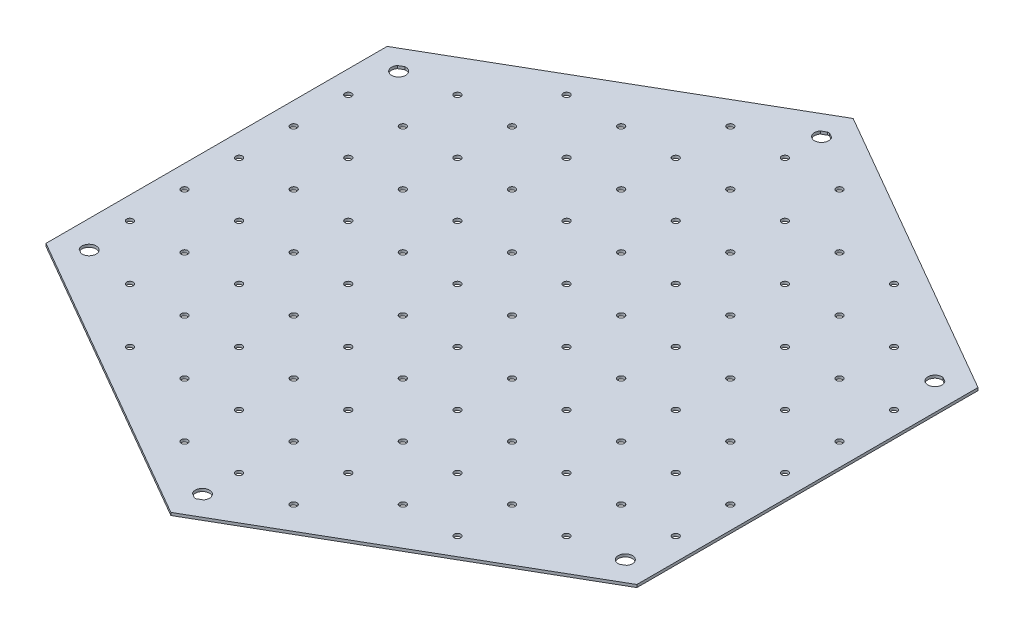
from build123d import *

# Parameters (mm, degrees)
BOSS_EXTRUDE1_DEPTH        = 0.5
SKETCH2_R                  = 0.6
CUT_EXTRUDE1_DEPTH         = 83.681240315
LPATTERN1_COUNT            = 6
LPATTERN1_PITCH            = 10
MIRROR1_COPY_1_SKETCH_R    = 0.6
MIRROR1_COPY_1_DEPTH       = 83.681240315
MIRROR1_COPY_2_SKETCH_R    = 0.6
MIRROR1_COPY_2_DEPTH       = 83.681240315
MIRROR1_COPY_3_SKETCH_R    = 0.6
MIRROR1_COPY_3_DEPTH       = 83.681240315
MIRROR1_COPY_4_SKETCH_R    = 0.6
MIRROR1_COPY_4_DEPTH       = 83.681240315
MIRROR1_COPY_5_SKETCH_R    = 0.6
MIRROR1_COPY_5_DEPTH       = 83.681240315
MIRROR1_COPY_6_SKETCH_R    = 0.6
MIRROR1_COPY_6_DEPTH       = 83.681240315
LPATTERN2_COPY_1_SKETCH_R  = 0.6
LPATTERN2_COPY_1_DEPTH     = 83.681240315
LPATTERN2_COPY_2_SKETCH_R  = 0.6
LPATTERN2_COPY_2_DEPTH     = 83.681240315
LPATTERN2_COPY_3_SKETCH_R  = 0.6
LPATTERN2_COPY_3_DEPTH     = 83.681240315
LPATTERN2_COPY_4_SKETCH_R  = 0.6
LPATTERN2_COPY_4_DEPTH     = 83.681240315
LPATTERN2_COPY_5_SKETCH_R  = 0.6
LPATTERN2_COPY_5_DEPTH     = 83.681240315
LPATTERN2_COPY_6_SKETCH_R  = 0.6
LPATTERN2_COPY_6_DEPTH     = 83.681240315
LPATTERN2_COPY_7_SKETCH_R  = 0.6
LPATTERN2_COPY_7_DEPTH     = 83.681240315
LPATTERN2_COPY_8_SKETCH_R  = 0.6
LPATTERN2_COPY_8_DEPTH     = 83.681240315
LPATTERN2_COPY_9_SKETCH_R  = 0.6
LPATTERN2_COPY_9_DEPTH     = 83.681240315
LPATTERN2_COPY_10_SKETCH_R = 0.6
LPATTERN2_COPY_10_DEPTH    = 83.681240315
LPATTERN2_COPY_11_SKETCH_R = 0.6
LPATTERN2_COPY_11_DEPTH    = 83.681240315
LPATTERN2_COPY_12_SKETCH_R = 0.6
LPATTERN2_COPY_12_DEPTH    = 83.681240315
LPATTERN2_COPY_13_SKETCH_R = 0.6
LPATTERN2_COPY_13_DEPTH    = 83.681240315
LPATTERN2_COPY_14_SKETCH_R = 0.6
LPATTERN2_COPY_14_DEPTH    = 83.681240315
LPATTERN2_COPY_15_SKETCH_R = 0.6
LPATTERN2_COPY_15_DEPTH    = 83.681240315
LPATTERN2_COPY_16_SKETCH_R = 0.6
LPATTERN2_COPY_16_DEPTH    = 83.681240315
LPATTERN2_COPY_17_SKETCH_R = 0.6
LPATTERN2_COPY_17_DEPTH    = 83.681240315
LPATTERN2_COPY_18_SKETCH_R = 0.6
LPATTERN2_COPY_18_DEPTH    = 83.681240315
LPATTERN2_COPY_19_SKETCH_R = 0.6
LPATTERN2_COPY_19_DEPTH    = 83.681240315
LPATTERN2_COPY_20_SKETCH_R = 0.6
LPATTERN2_COPY_20_DEPTH    = 83.681240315
LPATTERN2_COPY_21_SKETCH_R = 0.6
LPATTERN2_COPY_21_DEPTH    = 83.681240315
LPATTERN2_COPY_22_SKETCH_R = 0.6
LPATTERN2_COPY_22_DEPTH    = 83.681240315
LPATTERN2_COPY_23_SKETCH_R = 0.6
LPATTERN2_COPY_23_DEPTH    = 83.681240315
LPATTERN2_COPY_24_SKETCH_R = 0.6
LPATTERN2_COPY_24_DEPTH    = 83.681240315
LPATTERN2_COPY_25_SKETCH_R = 0.6
LPATTERN2_COPY_25_DEPTH    = 83.681240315
LPATTERN2_COPY_26_SKETCH_R = 0.6
LPATTERN2_COPY_26_DEPTH    = 83.681240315
LPATTERN2_COPY_27_SKETCH_R = 0.6
LPATTERN2_COPY_27_DEPTH    = 83.681240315
LPATTERN2_COPY_28_SKETCH_R = 0.6
LPATTERN2_COPY_28_DEPTH    = 83.681240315
LPATTERN2_COPY_29_SKETCH_R = 0.6
LPATTERN2_COPY_29_DEPTH    = 83.681240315
LPATTERN2_COPY_30_SKETCH_R = 0.6
LPATTERN2_COPY_30_DEPTH    = 83.681240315
LPATTERN2_COPY_31_SKETCH_R = 0.6
LPATTERN2_COPY_31_DEPTH    = 83.681240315
LPATTERN2_COPY_32_SKETCH_R = 0.6
LPATTERN2_COPY_32_DEPTH    = 83.681240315
LPATTERN2_COPY_33_SKETCH_R = 0.6
LPATTERN2_COPY_33_DEPTH    = 83.681240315
LPATTERN2_COPY_34_SKETCH_R = 0.6
LPATTERN2_COPY_34_DEPTH    = 83.681240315
LPATTERN2_COPY_35_SKETCH_R = 0.6
LPATTERN2_COPY_35_DEPTH    = 83.681240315
LPATTERN2_COPY_36_SKETCH_R = 0.6
LPATTERN2_COPY_36_DEPTH    = 83.681240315
LPATTERN2_COPY_37_SKETCH_R = 0.6
LPATTERN2_COPY_37_DEPTH    = 83.681240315
LPATTERN2_COPY_38_SKETCH_R = 0.6
LPATTERN2_COPY_38_DEPTH    = 83.681240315
LPATTERN2_COPY_39_SKETCH_R = 0.6
LPATTERN2_COPY_39_DEPTH    = 83.681240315
LPATTERN2_COPY_40_SKETCH_R = 0.6
LPATTERN2_COPY_40_DEPTH    = 83.681240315
LPATTERN2_COPY_41_SKETCH_R = 0.6
LPATTERN2_COPY_41_DEPTH    = 83.681240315
LPATTERN2_COPY_42_SKETCH_R = 0.6
LPATTERN2_COPY_42_DEPTH    = 83.681240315
LPATTERN2_COPY_43_SKETCH_R = 0.6
LPATTERN2_COPY_43_DEPTH    = 83.681240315
LPATTERN2_COPY_44_SKETCH_R = 0.6
LPATTERN2_COPY_44_DEPTH    = 83.681240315
LPATTERN2_COPY_45_SKETCH_R = 0.6
LPATTERN2_COPY_45_DEPTH    = 83.681240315
LPATTERN2_COPY_46_SKETCH_R = 0.6
LPATTERN2_COPY_46_DEPTH    = 83.681240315
LPATTERN2_COPY_47_SKETCH_R = 0.6
LPATTERN2_COPY_47_DEPTH    = 83.681240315
LPATTERN2_COPY_48_SKETCH_R = 0.6
LPATTERN2_COPY_48_DEPTH    = 83.681240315
LPATTERN2_COPY_49_SKETCH_R = 0.6
LPATTERN2_COPY_49_DEPTH    = 83.681240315
LPATTERN2_COPY_50_SKETCH_R = 0.6
LPATTERN2_COPY_50_DEPTH    = 83.681240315
LPATTERN2_COPY_51_SKETCH_R = 0.6
LPATTERN2_COPY_51_DEPTH    = 83.681240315
LPATTERN2_COPY_52_SKETCH_R = 0.6
LPATTERN2_COPY_52_DEPTH    = 83.681240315
LPATTERN2_COPY_53_SKETCH_R = 0.6
LPATTERN2_COPY_53_DEPTH    = 83.681240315
LPATTERN2_COPY_54_SKETCH_R = 0.6
LPATTERN2_COPY_54_DEPTH    = 83.681240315
LPATTERN2_COPY_55_SKETCH_R = 0.6
LPATTERN2_COPY_55_DEPTH    = 83.681240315
LPATTERN2_COPY_56_SKETCH_R = 0.6
LPATTERN2_COPY_56_DEPTH    = 83.681240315
LPATTERN2_COPY_57_SKETCH_R = 0.6
LPATTERN2_COPY_57_DEPTH    = 83.681240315
LPATTERN2_COPY_58_SKETCH_R = 0.6
LPATTERN2_COPY_58_DEPTH    = 83.681240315
LPATTERN2_COPY_59_SKETCH_R = 0.6
LPATTERN2_COPY_59_DEPTH    = 83.681240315
LPATTERN2_COPY_60_SKETCH_R = 0.6
LPATTERN2_COPY_60_DEPTH    = 83.681240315
LPATTERN2_COPY_61_SKETCH_R = 0.6
LPATTERN2_COPY_61_DEPTH    = 83.681240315
LPATTERN2_COPY_62_SKETCH_R = 0.6
LPATTERN2_COPY_62_DEPTH    = 83.681240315
LPATTERN2_COPY_63_SKETCH_R = 0.6
LPATTERN2_COPY_63_DEPTH    = 83.681240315
LPATTERN2_COPY_64_SKETCH_R = 0.6
LPATTERN2_COPY_64_DEPTH    = 83.681240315
LPATTERN2_COPY_65_SKETCH_R = 0.6
LPATTERN2_COPY_65_DEPTH    = 83.681240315
LPATTERN2_COPY_66_SKETCH_R = 0.6
LPATTERN2_COPY_66_DEPTH    = 83.681240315
LPATTERN2_COPY_67_SKETCH_R = 0.6
LPATTERN2_COPY_67_DEPTH    = 83.681240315
LPATTERN2_COPY_68_SKETCH_R = 0.6
LPATTERN2_COPY_68_DEPTH    = 83.681240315
LPATTERN2_COPY_69_SKETCH_R = 0.6
LPATTERN2_COPY_69_DEPTH    = 83.681240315
LPATTERN2_COPY_70_SKETCH_R = 0.6
LPATTERN2_COPY_70_DEPTH    = 83.681240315
LPATTERN2_COPY_71_SKETCH_R = 0.6
LPATTERN2_COPY_71_DEPTH    = 83.681240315
LPATTERN2_COPY_72_SKETCH_R = 0.6
LPATTERN2_COPY_72_DEPTH    = 83.681240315
LPATTERN2_COPY_73_SKETCH_R = 0.6
LPATTERN2_COPY_73_DEPTH    = 83.681240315
LPATTERN2_COPY_74_SKETCH_R = 0.6
LPATTERN2_COPY_74_DEPTH    = 83.681240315
LPATTERN2_COPY_75_SKETCH_R = 0.6
LPATTERN2_COPY_75_DEPTH    = 83.681240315
LPATTERN2_COPY_76_SKETCH_R = 0.6
LPATTERN2_COPY_76_DEPTH    = 83.681240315
LPATTERN2_COPY_77_SKETCH_R = 0.6
LPATTERN2_COPY_77_DEPTH    = 83.681240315
LPATTERN2_COPY_78_SKETCH_R = 0.6
LPATTERN2_COPY_78_DEPTH    = 83.681240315
MIRROR2_COPY_1_SKETCH_R    = 0.6
MIRROR2_COPY_1_DEPTH       = 83.681240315
MIRROR2_COPY_2_SKETCH_R    = 0.6
MIRROR2_COPY_2_DEPTH       = 83.681240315
MIRROR2_COPY_3_SKETCH_R    = 0.6
MIRROR2_COPY_3_DEPTH       = 83.681240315
MIRROR2_COPY_4_SKETCH_R    = 0.6
MIRROR2_COPY_4_DEPTH       = 83.681240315
MIRROR2_COPY_5_SKETCH_R    = 0.6
MIRROR2_COPY_5_DEPTH       = 83.681240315
MIRROR2_COPY_6_SKETCH_R    = 0.6
MIRROR2_COPY_6_DEPTH       = 83.681240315
MIRROR2_COPY_7_SKETCH_R    = 0.6
MIRROR2_COPY_7_DEPTH       = 83.681240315
MIRROR2_COPY_8_SKETCH_R    = 0.6
MIRROR2_COPY_8_DEPTH       = 83.681240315
MIRROR2_COPY_9_SKETCH_R    = 0.6
MIRROR2_COPY_9_DEPTH       = 83.681240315
MIRROR2_COPY_10_SKETCH_R   = 0.6
MIRROR2_COPY_10_DEPTH      = 83.681240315
MIRROR2_COPY_11_SKETCH_R   = 0.6
MIRROR2_COPY_11_DEPTH      = 83.681240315
MIRROR2_COPY_12_SKETCH_R   = 0.6
MIRROR2_COPY_12_DEPTH      = 83.681240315
MIRROR2_COPY_13_SKETCH_R   = 0.6
MIRROR2_COPY_13_DEPTH      = 83.681240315
MIRROR2_COPY_14_SKETCH_R   = 0.6
MIRROR2_COPY_14_DEPTH      = 83.681240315
MIRROR2_COPY_15_SKETCH_R   = 0.6
MIRROR2_COPY_15_DEPTH      = 83.681240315
MIRROR2_COPY_16_SKETCH_R   = 0.6
MIRROR2_COPY_16_DEPTH      = 83.681240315
MIRROR2_COPY_17_SKETCH_R   = 0.6
MIRROR2_COPY_17_DEPTH      = 83.681240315
MIRROR2_COPY_18_SKETCH_R   = 0.6
MIRROR2_COPY_18_DEPTH      = 83.681240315
MIRROR2_COPY_19_SKETCH_R   = 0.6
MIRROR2_COPY_19_DEPTH      = 83.681240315
MIRROR2_COPY_20_SKETCH_R   = 0.6
MIRROR2_COPY_20_DEPTH      = 83.681240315
MIRROR2_COPY_21_SKETCH_R   = 0.6
MIRROR2_COPY_21_DEPTH      = 83.681240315
MIRROR2_COPY_22_SKETCH_R   = 0.6
MIRROR2_COPY_22_DEPTH      = 83.681240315
MIRROR2_COPY_23_SKETCH_R   = 0.6
MIRROR2_COPY_23_DEPTH      = 83.681240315
MIRROR2_COPY_24_SKETCH_R   = 0.6
MIRROR2_COPY_24_DEPTH      = 83.681240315
MIRROR2_COPY_25_SKETCH_R   = 0.6
MIRROR2_COPY_25_DEPTH      = 83.681240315
MIRROR2_COPY_26_SKETCH_R   = 0.6
MIRROR2_COPY_26_DEPTH      = 83.681240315
MIRROR2_COPY_27_SKETCH_R   = 0.6
MIRROR2_COPY_27_DEPTH      = 83.681240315
MIRROR2_COPY_28_SKETCH_R   = 0.6
MIRROR2_COPY_28_DEPTH      = 83.681240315
MIRROR2_COPY_29_SKETCH_R   = 0.6
MIRROR2_COPY_29_DEPTH      = 83.681240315
MIRROR2_COPY_30_SKETCH_R   = 0.6
MIRROR2_COPY_30_DEPTH      = 83.681240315
MIRROR2_COPY_31_SKETCH_R   = 0.6
MIRROR2_COPY_31_DEPTH      = 83.681240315
MIRROR2_COPY_32_SKETCH_R   = 0.6
MIRROR2_COPY_32_DEPTH      = 83.681240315
MIRROR2_COPY_33_SKETCH_R   = 0.6
MIRROR2_COPY_33_DEPTH      = 83.681240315
MIRROR2_COPY_34_SKETCH_R   = 0.6
MIRROR2_COPY_34_DEPTH      = 83.681240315
MIRROR2_COPY_35_SKETCH_R   = 0.6
MIRROR2_COPY_35_DEPTH      = 83.681240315
MIRROR2_COPY_36_SKETCH_R   = 0.6
MIRROR2_COPY_36_DEPTH      = 83.681240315
MIRROR2_COPY_37_SKETCH_R   = 0.6
MIRROR2_COPY_37_DEPTH      = 83.681240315
MIRROR2_COPY_38_SKETCH_R   = 0.6
MIRROR2_COPY_38_DEPTH      = 83.681240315
MIRROR2_COPY_39_SKETCH_R   = 0.6
MIRROR2_COPY_39_DEPTH      = 83.681240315
MIRROR2_COPY_40_SKETCH_R   = 0.6
MIRROR2_COPY_40_DEPTH      = 83.681240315
MIRROR2_COPY_41_SKETCH_R   = 0.6
MIRROR2_COPY_41_DEPTH      = 83.681240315
MIRROR2_COPY_42_SKETCH_R   = 0.6
MIRROR2_COPY_42_DEPTH      = 83.681240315
MIRROR2_COPY_43_SKETCH_R   = 0.6
MIRROR2_COPY_43_DEPTH      = 83.681240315
MIRROR2_COPY_44_SKETCH_R   = 0.6
MIRROR2_COPY_44_DEPTH      = 83.681240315
MIRROR2_COPY_45_SKETCH_R   = 0.6
MIRROR2_COPY_45_DEPTH      = 83.681240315
MIRROR2_COPY_46_SKETCH_R   = 0.6
MIRROR2_COPY_46_DEPTH      = 83.681240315
MIRROR2_COPY_47_SKETCH_R   = 0.6
MIRROR2_COPY_47_DEPTH      = 83.681240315
MIRROR2_COPY_48_SKETCH_R   = 0.6
MIRROR2_COPY_48_DEPTH      = 83.681240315
MIRROR2_COPY_49_SKETCH_R   = 0.6
MIRROR2_COPY_49_DEPTH      = 83.681240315
MIRROR2_COPY_50_SKETCH_R   = 0.6
MIRROR2_COPY_50_DEPTH      = 83.681240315
MIRROR2_COPY_51_SKETCH_R   = 0.6
MIRROR2_COPY_51_DEPTH      = 83.681240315
MIRROR2_COPY_52_SKETCH_R   = 0.6
MIRROR2_COPY_52_DEPTH      = 83.681240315
MIRROR2_COPY_53_SKETCH_R   = 0.6
MIRROR2_COPY_53_DEPTH      = 83.681240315
MIRROR2_COPY_54_SKETCH_R   = 0.6
MIRROR2_COPY_54_DEPTH      = 83.681240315
MIRROR2_COPY_55_SKETCH_R   = 0.6
MIRROR2_COPY_55_DEPTH      = 83.681240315
MIRROR2_COPY_56_SKETCH_R   = 0.6
MIRROR2_COPY_56_DEPTH      = 83.681240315
MIRROR2_COPY_57_SKETCH_R   = 0.6
MIRROR2_COPY_57_DEPTH      = 83.681240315
MIRROR2_COPY_58_SKETCH_R   = 0.6
MIRROR2_COPY_58_DEPTH      = 83.681240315
MIRROR2_COPY_59_SKETCH_R   = 0.6
MIRROR2_COPY_59_DEPTH      = 83.681240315
MIRROR2_COPY_60_SKETCH_R   = 0.6
MIRROR2_COPY_60_DEPTH      = 83.681240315
MIRROR2_COPY_61_SKETCH_R   = 0.6
MIRROR2_COPY_61_DEPTH      = 83.681240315
MIRROR2_COPY_62_SKETCH_R   = 0.6
MIRROR2_COPY_62_DEPTH      = 83.681240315
MIRROR2_COPY_63_SKETCH_R   = 0.6
MIRROR2_COPY_63_DEPTH      = 83.681240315
MIRROR2_COPY_64_SKETCH_R   = 0.6
MIRROR2_COPY_64_DEPTH      = 83.681240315
MIRROR2_COPY_65_SKETCH_R   = 0.6
MIRROR2_COPY_65_DEPTH      = 83.681240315
MIRROR2_COPY_66_SKETCH_R   = 0.6
MIRROR2_COPY_66_DEPTH      = 83.681240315
MIRROR2_COPY_67_SKETCH_R   = 0.6
MIRROR2_COPY_67_DEPTH      = 83.681240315
MIRROR2_COPY_68_SKETCH_R   = 0.6
MIRROR2_COPY_68_DEPTH      = 83.681240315
MIRROR2_COPY_69_SKETCH_R   = 0.6
MIRROR2_COPY_69_DEPTH      = 83.681240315
MIRROR2_COPY_70_SKETCH_R   = 0.6
MIRROR2_COPY_70_DEPTH      = 83.681240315
MIRROR2_COPY_71_SKETCH_R   = 0.6
MIRROR2_COPY_71_DEPTH      = 83.681240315
MIRROR2_COPY_72_SKETCH_R   = 0.6
MIRROR2_COPY_72_DEPTH      = 83.681240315
MIRROR2_COPY_73_SKETCH_R   = 0.6
MIRROR2_COPY_73_DEPTH      = 83.681240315
MIRROR2_COPY_74_SKETCH_R   = 0.6
MIRROR2_COPY_74_DEPTH      = 83.681240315
MIRROR2_COPY_75_SKETCH_R   = 0.6
MIRROR2_COPY_75_DEPTH      = 83.681240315
MIRROR2_COPY_76_SKETCH_R   = 0.6
MIRROR2_COPY_76_DEPTH      = 83.681240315
MIRROR2_COPY_77_SKETCH_R   = 0.6
MIRROR2_COPY_77_DEPTH      = 83.681240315
MIRROR2_COPY_78_SKETCH_R   = 0.6
MIRROR2_COPY_78_DEPTH      = 83.681240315
MIRROR2_COPY_79_SKETCH_R   = 0.6
MIRROR2_COPY_79_DEPTH      = 83.681240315
SKETCH4_R                  = 1.3
CUT_EXTRUDE3_DEPTH         = 83.681240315
BOSS_EXTRUDE2_DEPTH        = 0.5
BOSS_EXTRUDE3_DEPTH        = 0.5
BOSS_EXTRUDE4_DEPTH        = 0.5


with BuildPart() as part:
    # Sketch1 → Boss-Extrude1 (new body)
    with BuildSketch(Plane(origin=(0, 0, 0), x_dir=(1, 0, 0), z_dir=(0, 1, 0))):
        Polygon((0, 62.5), (-54.126587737, 31.25), (-54.126587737, -31.25), (0, -62.5), (54.126587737, -31.25), (54.126587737, 31.25), align=None)
    extrude(amount=BOSS_EXTRUDE1_DEPTH)

    # Sketch2 → Cut-Extrude1 (cut, through all)
    with BuildSketch(Plane(origin=(0, 0.5, 0), x_dir=(1, 0, 0), z_dir=(0, 1, 0))):
        with Locations(Location((0, 0, 0), (0, 0, 270))):
            Circle(SKETCH2_R)
    cut_extrude1 = extrude(amount=-CUT_EXTRUDE1_DEPTH, mode=Mode.SUBTRACT)

    # LPattern1: Cut-Extrude1 ×6
    with Locations(*[(-i * LPATTERN1_PITCH, 0, 0) for i in range(1, LPATTERN1_COUNT)]):
        add(cut_extrude1, mode=Mode.SUBTRACT)

    # Mirror1 copy 1 sketch → Mirror1 copy 1 (cut, through all)
    with BuildSketch(Plane(origin=(10, 0.5, 0), x_dir=(-1, 0, 0), z_dir=(0, 1, 0))):
        Circle(MIRROR1_COPY_1_SKETCH_R)
    extrude(amount=-MIRROR1_COPY_1_DEPTH, mode=Mode.SUBTRACT)

    # Mirror1 copy 2 sketch → Mirror1 copy 2 (cut, through all)
    with BuildSketch(Plane(origin=(20, 0.5, 0), x_dir=(-1, 0, 0), z_dir=(0, 1, 0))):
        Circle(MIRROR1_COPY_2_SKETCH_R)
    extrude(amount=-MIRROR1_COPY_2_DEPTH, mode=Mode.SUBTRACT)

    # Mirror1 copy 3 sketch → Mirror1 copy 3 (cut, through all)
    with BuildSketch(Plane(origin=(30, 0.5, 0), x_dir=(-1, 0, 0), z_dir=(0, 1, 0))):
        Circle(MIRROR1_COPY_3_SKETCH_R)
    extrude(amount=-MIRROR1_COPY_3_DEPTH, mode=Mode.SUBTRACT)

    # Mirror1 copy 4 sketch → Mirror1 copy 4 (cut, through all)
    with BuildSketch(Plane(origin=(40, 0.5, 0), x_dir=(-1, 0, 0), z_dir=(0, 1, 0))):
        Circle(MIRROR1_COPY_4_SKETCH_R)
    extrude(amount=-MIRROR1_COPY_4_DEPTH, mode=Mode.SUBTRACT)

    # Mirror1 copy 5 sketch → Mirror1 copy 5 (cut, through all)
    with BuildSketch(Plane(origin=(50, 0.5, 0), x_dir=(-1, 0, 0), z_dir=(0, 1, 0))):
        Circle(MIRROR1_COPY_5_SKETCH_R)
    extrude(amount=-MIRROR1_COPY_5_DEPTH, mode=Mode.SUBTRACT)

    # Mirror1 copy 6 sketch → Mirror1 copy 6 (cut, through all)
    with BuildSketch(Plane(origin=(0, 0.5, 0), x_dir=(-1, 0, 0), z_dir=(0, 1, 0))):
        Circle(MIRROR1_COPY_6_SKETCH_R)
    extrude(amount=-MIRROR1_COPY_6_DEPTH, mode=Mode.SUBTRACT)

    # LPattern2 copy 1 sketch → LPattern2 copy 1 (cut, through all)
    with BuildSketch(Plane(origin=(-10, 0.5, 10), x_dir=(1, 0, 0), z_dir=(0, 1, 0))):
        with Locations(Location((0, 0, 0), (0, 0, 270))):
            Circle(LPATTERN2_COPY_1_SKETCH_R)
    extrude(amount=-LPATTERN2_COPY_1_DEPTH, mode=Mode.SUBTRACT)

    # LPattern2 copy 2 sketch → LPattern2 copy 2 (cut, through all)
    with BuildSketch(Plane(origin=(-10, 0.5, 20), x_dir=(1, 0, 0), z_dir=(0, 1, 0))):
        with Locations(Location((0, 0, 0), (0, 0, 270))):
            Circle(LPATTERN2_COPY_2_SKETCH_R)
    extrude(amount=-LPATTERN2_COPY_2_DEPTH, mode=Mode.SUBTRACT)

    # LPattern2 copy 3 sketch → LPattern2 copy 3 (cut, through all)
    with BuildSketch(Plane(origin=(-10, 0.5, 30), x_dir=(1, 0, 0), z_dir=(0, 1, 0))):
        with Locations(Location((0, 0, 0), (0, 0, 270))):
            Circle(LPATTERN2_COPY_3_SKETCH_R)
    extrude(amount=-LPATTERN2_COPY_3_DEPTH, mode=Mode.SUBTRACT)

    # LPattern2 copy 4 sketch → LPattern2 copy 4 (cut, through all)
    with BuildSketch(Plane(origin=(-10, 0.5, 40), x_dir=(1, 0, 0), z_dir=(0, 1, 0))):
        with Locations(Location((0, 0, 0), (0, 0, 270))):
            Circle(LPATTERN2_COPY_4_SKETCH_R)
    extrude(amount=-LPATTERN2_COPY_4_DEPTH, mode=Mode.SUBTRACT)

    # LPattern2 copy 5 sketch → LPattern2 copy 5 (cut, through all)
    with BuildSketch(Plane(origin=(-10, 0.5, 50), x_dir=(1, 0, 0), z_dir=(0, 1, 0))):
        with Locations(Location((0, 0, 0), (0, 0, 270))):
            Circle(LPATTERN2_COPY_5_SKETCH_R)
    extrude(amount=-LPATTERN2_COPY_5_DEPTH, mode=Mode.SUBTRACT)

    # LPattern2 copy 6 sketch → LPattern2 copy 6 (cut, through all)
    with BuildSketch(Plane(origin=(-10, 0.5, 60), x_dir=(1, 0, 0), z_dir=(0, 1, 0))):
        with Locations(Location((0, 0, 0), (0, 0, 270))):
            Circle(LPATTERN2_COPY_6_SKETCH_R)
    extrude(amount=-LPATTERN2_COPY_6_DEPTH, mode=Mode.SUBTRACT)

    # LPattern2 copy 7 sketch → LPattern2 copy 7 (cut, through all)
    with BuildSketch(Plane(origin=(-20, 0.5, 10), x_dir=(1, 0, 0), z_dir=(0, 1, 0))):
        with Locations(Location((0, 0, 0), (0, 0, 270))):
            Circle(LPATTERN2_COPY_7_SKETCH_R)
    extrude(amount=-LPATTERN2_COPY_7_DEPTH, mode=Mode.SUBTRACT)

    # LPattern2 copy 8 sketch → LPattern2 copy 8 (cut, through all)
    with BuildSketch(Plane(origin=(-20, 0.5, 20), x_dir=(1, 0, 0), z_dir=(0, 1, 0))):
        with Locations(Location((0, 0, 0), (0, 0, 270))):
            Circle(LPATTERN2_COPY_8_SKETCH_R)
    extrude(amount=-LPATTERN2_COPY_8_DEPTH, mode=Mode.SUBTRACT)

    # LPattern2 copy 9 sketch → LPattern2 copy 9 (cut, through all)
    with BuildSketch(Plane(origin=(-20, 0.5, 30), x_dir=(1, 0, 0), z_dir=(0, 1, 0))):
        with Locations(Location((0, 0, 0), (0, 0, 270))):
            Circle(LPATTERN2_COPY_9_SKETCH_R)
    extrude(amount=-LPATTERN2_COPY_9_DEPTH, mode=Mode.SUBTRACT)

    # LPattern2 copy 10 sketch → LPattern2 copy 10 (cut, through all)
    with BuildSketch(Plane(origin=(-20, 0.5, 40), x_dir=(1, 0, 0), z_dir=(0, 1, 0))):
        with Locations(Location((0, 0, 0), (0, 0, 270))):
            Circle(LPATTERN2_COPY_10_SKETCH_R)
    extrude(amount=-LPATTERN2_COPY_10_DEPTH, mode=Mode.SUBTRACT)

    # LPattern2 copy 11 sketch → LPattern2 copy 11 (cut, through all)
    with BuildSketch(Plane(origin=(-20, 0.5, 50), x_dir=(1, 0, 0), z_dir=(0, 1, 0))):
        with Locations(Location((0, 0, 0), (0, 0, 270))):
            Circle(LPATTERN2_COPY_11_SKETCH_R)
    extrude(amount=-LPATTERN2_COPY_11_DEPTH, mode=Mode.SUBTRACT)

    # LPattern2 copy 12 sketch → LPattern2 copy 12 (cut, through all)
    with BuildSketch(Plane(origin=(-20, 0.5, 60), x_dir=(1, 0, 0), z_dir=(0, 1, 0))):
        with Locations(Location((0, 0, 0), (0, 0, 270))):
            Circle(LPATTERN2_COPY_12_SKETCH_R)
    extrude(amount=-LPATTERN2_COPY_12_DEPTH, mode=Mode.SUBTRACT)

    # LPattern2 copy 13 sketch → LPattern2 copy 13 (cut, through all)
    with BuildSketch(Plane(origin=(-30, 0.5, 10), x_dir=(1, 0, 0), z_dir=(0, 1, 0))):
        with Locations(Location((0, 0, 0), (0, 0, 270))):
            Circle(LPATTERN2_COPY_13_SKETCH_R)
    extrude(amount=-LPATTERN2_COPY_13_DEPTH, mode=Mode.SUBTRACT)

    # LPattern2 copy 14 sketch → LPattern2 copy 14 (cut, through all)
    with BuildSketch(Plane(origin=(-30, 0.5, 20), x_dir=(1, 0, 0), z_dir=(0, 1, 0))):
        with Locations(Location((0, 0, 0), (0, 0, 270))):
            Circle(LPATTERN2_COPY_14_SKETCH_R)
    extrude(amount=-LPATTERN2_COPY_14_DEPTH, mode=Mode.SUBTRACT)

    # LPattern2 copy 15 sketch → LPattern2 copy 15 (cut, through all)
    with BuildSketch(Plane(origin=(-30, 0.5, 30), x_dir=(1, 0, 0), z_dir=(0, 1, 0))):
        with Locations(Location((0, 0, 0), (0, 0, 270))):
            Circle(LPATTERN2_COPY_15_SKETCH_R)
    extrude(amount=-LPATTERN2_COPY_15_DEPTH, mode=Mode.SUBTRACT)

    # LPattern2 copy 16 sketch → LPattern2 copy 16 (cut, through all)
    with BuildSketch(Plane(origin=(-30, 0.5, 40), x_dir=(1, 0, 0), z_dir=(0, 1, 0))):
        with Locations(Location((0, 0, 0), (0, 0, 270))):
            Circle(LPATTERN2_COPY_16_SKETCH_R)
    extrude(amount=-LPATTERN2_COPY_16_DEPTH, mode=Mode.SUBTRACT)

    # LPattern2 copy 17 sketch → LPattern2 copy 17 (cut, through all)
    with BuildSketch(Plane(origin=(-30, 0.5, 50), x_dir=(1, 0, 0), z_dir=(0, 1, 0))):
        with Locations(Location((0, 0, 0), (0, 0, 270))):
            Circle(LPATTERN2_COPY_17_SKETCH_R)
    extrude(amount=-LPATTERN2_COPY_17_DEPTH, mode=Mode.SUBTRACT)

    # LPattern2 copy 18 sketch → LPattern2 copy 18 (cut, through all)
    with BuildSketch(Plane(origin=(-30, 0.5, 60), x_dir=(1, 0, 0), z_dir=(0, 1, 0))):
        with Locations(Location((0, 0, 0), (0, 0, 270))):
            Circle(LPATTERN2_COPY_18_SKETCH_R)
    extrude(amount=-LPATTERN2_COPY_18_DEPTH, mode=Mode.SUBTRACT)

    # LPattern2 copy 19 sketch → LPattern2 copy 19 (cut, through all)
    with BuildSketch(Plane(origin=(-40, 0.5, 10), x_dir=(1, 0, 0), z_dir=(0, 1, 0))):
        with Locations(Location((0, 0, 0), (0, 0, 270))):
            Circle(LPATTERN2_COPY_19_SKETCH_R)
    extrude(amount=-LPATTERN2_COPY_19_DEPTH, mode=Mode.SUBTRACT)

    # LPattern2 copy 20 sketch → LPattern2 copy 20 (cut, through all)
    with BuildSketch(Plane(origin=(-40, 0.5, 20), x_dir=(1, 0, 0), z_dir=(0, 1, 0))):
        with Locations(Location((0, 0, 0), (0, 0, 270))):
            Circle(LPATTERN2_COPY_20_SKETCH_R)
    extrude(amount=-LPATTERN2_COPY_20_DEPTH, mode=Mode.SUBTRACT)

    # LPattern2 copy 21 sketch → LPattern2 copy 21 (cut, through all)
    with BuildSketch(Plane(origin=(-40, 0.5, 30), x_dir=(1, 0, 0), z_dir=(0, 1, 0))):
        with Locations(Location((0, 0, 0), (0, 0, 270))):
            Circle(LPATTERN2_COPY_21_SKETCH_R)
    extrude(amount=-LPATTERN2_COPY_21_DEPTH, mode=Mode.SUBTRACT)

    # LPattern2 copy 22 sketch → LPattern2 copy 22 (cut, through all)
    with BuildSketch(Plane(origin=(-40, 0.5, 40), x_dir=(1, 0, 0), z_dir=(0, 1, 0))):
        with Locations(Location((0, 0, 0), (0, 0, 270))):
            Circle(LPATTERN2_COPY_22_SKETCH_R)
    extrude(amount=-LPATTERN2_COPY_22_DEPTH, mode=Mode.SUBTRACT)

    # LPattern2 copy 23 sketch → LPattern2 copy 23 (cut, through all)
    with BuildSketch(Plane(origin=(-40, 0.5, 50), x_dir=(1, 0, 0), z_dir=(0, 1, 0))):
        with Locations(Location((0, 0, 0), (0, 0, 270))):
            Circle(LPATTERN2_COPY_23_SKETCH_R)
    extrude(amount=-LPATTERN2_COPY_23_DEPTH, mode=Mode.SUBTRACT)

    # LPattern2 copy 24 sketch → LPattern2 copy 24 (cut, through all)
    with BuildSketch(Plane(origin=(-40, 0.5, 60), x_dir=(1, 0, 0), z_dir=(0, 1, 0))):
        with Locations(Location((0, 0, 0), (0, 0, 270))):
            Circle(LPATTERN2_COPY_24_SKETCH_R)
    extrude(amount=-LPATTERN2_COPY_24_DEPTH, mode=Mode.SUBTRACT)

    # LPattern2 copy 25 sketch → LPattern2 copy 25 (cut, through all)
    with BuildSketch(Plane(origin=(-50, 0.5, 10), x_dir=(1, 0, 0), z_dir=(0, 1, 0))):
        with Locations(Location((0, 0, 0), (0, 0, 270))):
            Circle(LPATTERN2_COPY_25_SKETCH_R)
    extrude(amount=-LPATTERN2_COPY_25_DEPTH, mode=Mode.SUBTRACT)

    # LPattern2 copy 26 sketch → LPattern2 copy 26 (cut, through all)
    with BuildSketch(Plane(origin=(-50, 0.5, 20), x_dir=(1, 0, 0), z_dir=(0, 1, 0))):
        with Locations(Location((0, 0, 0), (0, 0, 270))):
            Circle(LPATTERN2_COPY_26_SKETCH_R)
    extrude(amount=-LPATTERN2_COPY_26_DEPTH, mode=Mode.SUBTRACT)

    # LPattern2 copy 27 sketch → LPattern2 copy 27 (cut, through all)
    with BuildSketch(Plane(origin=(-50, 0.5, 30), x_dir=(1, 0, 0), z_dir=(0, 1, 0))):
        with Locations(Location((0, 0, 0), (0, 0, 270))):
            Circle(LPATTERN2_COPY_27_SKETCH_R)
    extrude(amount=-LPATTERN2_COPY_27_DEPTH, mode=Mode.SUBTRACT)

    # LPattern2 copy 28 sketch → LPattern2 copy 28 (cut, through all)
    with BuildSketch(Plane(origin=(-50, 0.5, 40), x_dir=(1, 0, 0), z_dir=(0, 1, 0))):
        with Locations(Location((0, 0, 0), (0, 0, 270))):
            Circle(LPATTERN2_COPY_28_SKETCH_R)
    extrude(amount=-LPATTERN2_COPY_28_DEPTH, mode=Mode.SUBTRACT)

    # LPattern2 copy 29 sketch → LPattern2 copy 29 (cut, through all)
    with BuildSketch(Plane(origin=(-50, 0.5, 50), x_dir=(1, 0, 0), z_dir=(0, 1, 0))):
        with Locations(Location((0, 0, 0), (0, 0, 270))):
            Circle(LPATTERN2_COPY_29_SKETCH_R)
    extrude(amount=-LPATTERN2_COPY_29_DEPTH, mode=Mode.SUBTRACT)

    # LPattern2 copy 30 sketch → LPattern2 copy 30 (cut, through all)
    with BuildSketch(Plane(origin=(-50, 0.5, 60), x_dir=(1, 0, 0), z_dir=(0, 1, 0))):
        with Locations(Location((0, 0, 0), (0, 0, 270))):
            Circle(LPATTERN2_COPY_30_SKETCH_R)
    extrude(amount=-LPATTERN2_COPY_30_DEPTH, mode=Mode.SUBTRACT)

    # LPattern2 copy 31 sketch → LPattern2 copy 31 (cut, through all)
    with BuildSketch(Plane(origin=(0, 0.5, 10), x_dir=(1, 0, 0), z_dir=(0, 1, 0))):
        with Locations(Location((0, 0, 0), (0, 0, 270))):
            Circle(LPATTERN2_COPY_31_SKETCH_R)
    extrude(amount=-LPATTERN2_COPY_31_DEPTH, mode=Mode.SUBTRACT)

    # LPattern2 copy 32 sketch → LPattern2 copy 32 (cut, through all)
    with BuildSketch(Plane(origin=(0, 0.5, 20), x_dir=(1, 0, 0), z_dir=(0, 1, 0))):
        with Locations(Location((0, 0, 0), (0, 0, 270))):
            Circle(LPATTERN2_COPY_32_SKETCH_R)
    extrude(amount=-LPATTERN2_COPY_32_DEPTH, mode=Mode.SUBTRACT)

    # LPattern2 copy 33 sketch → LPattern2 copy 33 (cut, through all)
    with BuildSketch(Plane(origin=(0, 0.5, 30), x_dir=(1, 0, 0), z_dir=(0, 1, 0))):
        with Locations(Location((0, 0, 0), (0, 0, 270))):
            Circle(LPATTERN2_COPY_33_SKETCH_R)
    extrude(amount=-LPATTERN2_COPY_33_DEPTH, mode=Mode.SUBTRACT)

    # LPattern2 copy 34 sketch → LPattern2 copy 34 (cut, through all)
    with BuildSketch(Plane(origin=(0, 0.5, 40), x_dir=(1, 0, 0), z_dir=(0, 1, 0))):
        with Locations(Location((0, 0, 0), (0, 0, 270))):
            Circle(LPATTERN2_COPY_34_SKETCH_R)
    extrude(amount=-LPATTERN2_COPY_34_DEPTH, mode=Mode.SUBTRACT)

    # LPattern2 copy 35 sketch → LPattern2 copy 35 (cut, through all)
    with BuildSketch(Plane(origin=(0, 0.5, 50), x_dir=(1, 0, 0), z_dir=(0, 1, 0))):
        with Locations(Location((0, 0, 0), (0, 0, 270))):
            Circle(LPATTERN2_COPY_35_SKETCH_R)
    extrude(amount=-LPATTERN2_COPY_35_DEPTH, mode=Mode.SUBTRACT)

    # LPattern2 copy 36 sketch → LPattern2 copy 36 (cut, through all)
    with BuildSketch(Plane(origin=(0, 0.5, 60), x_dir=(1, 0, 0), z_dir=(0, 1, 0))):
        with Locations(Location((0, 0, 0), (0, 0, 270))):
            Circle(LPATTERN2_COPY_36_SKETCH_R)
    extrude(amount=-LPATTERN2_COPY_36_DEPTH, mode=Mode.SUBTRACT)

    # LPattern2 copy 37 sketch → LPattern2 copy 37 (cut, through all)
    with BuildSketch(Plane(origin=(10, 0.5, 10), x_dir=(-1, 0, 0), z_dir=(0, 1, 0))):
        Circle(LPATTERN2_COPY_37_SKETCH_R)
    extrude(amount=-LPATTERN2_COPY_37_DEPTH, mode=Mode.SUBTRACT)

    # LPattern2 copy 38 sketch → LPattern2 copy 38 (cut, through all)
    with BuildSketch(Plane(origin=(10, 0.5, 20), x_dir=(-1, 0, 0), z_dir=(0, 1, 0))):
        Circle(LPATTERN2_COPY_38_SKETCH_R)
    extrude(amount=-LPATTERN2_COPY_38_DEPTH, mode=Mode.SUBTRACT)

    # LPattern2 copy 39 sketch → LPattern2 copy 39 (cut, through all)
    with BuildSketch(Plane(origin=(10, 0.5, 30), x_dir=(-1, 0, 0), z_dir=(0, 1, 0))):
        Circle(LPATTERN2_COPY_39_SKETCH_R)
    extrude(amount=-LPATTERN2_COPY_39_DEPTH, mode=Mode.SUBTRACT)

    # LPattern2 copy 40 sketch → LPattern2 copy 40 (cut, through all)
    with BuildSketch(Plane(origin=(10, 0.5, 40), x_dir=(-1, 0, 0), z_dir=(0, 1, 0))):
        Circle(LPATTERN2_COPY_40_SKETCH_R)
    extrude(amount=-LPATTERN2_COPY_40_DEPTH, mode=Mode.SUBTRACT)

    # LPattern2 copy 41 sketch → LPattern2 copy 41 (cut, through all)
    with BuildSketch(Plane(origin=(10, 0.5, 50), x_dir=(-1, 0, 0), z_dir=(0, 1, 0))):
        Circle(LPATTERN2_COPY_41_SKETCH_R)
    extrude(amount=-LPATTERN2_COPY_41_DEPTH, mode=Mode.SUBTRACT)

    # LPattern2 copy 42 sketch → LPattern2 copy 42 (cut, through all)
    with BuildSketch(Plane(origin=(10, 0.5, 60), x_dir=(-1, 0, 0), z_dir=(0, 1, 0))):
        Circle(LPATTERN2_COPY_42_SKETCH_R)
    extrude(amount=-LPATTERN2_COPY_42_DEPTH, mode=Mode.SUBTRACT)

    # LPattern2 copy 43 sketch → LPattern2 copy 43 (cut, through all)
    with BuildSketch(Plane(origin=(20, 0.5, 10), x_dir=(-1, 0, 0), z_dir=(0, 1, 0))):
        Circle(LPATTERN2_COPY_43_SKETCH_R)
    extrude(amount=-LPATTERN2_COPY_43_DEPTH, mode=Mode.SUBTRACT)

    # LPattern2 copy 44 sketch → LPattern2 copy 44 (cut, through all)
    with BuildSketch(Plane(origin=(20, 0.5, 20), x_dir=(-1, 0, 0), z_dir=(0, 1, 0))):
        Circle(LPATTERN2_COPY_44_SKETCH_R)
    extrude(amount=-LPATTERN2_COPY_44_DEPTH, mode=Mode.SUBTRACT)

    # LPattern2 copy 45 sketch → LPattern2 copy 45 (cut, through all)
    with BuildSketch(Plane(origin=(20, 0.5, 30), x_dir=(-1, 0, 0), z_dir=(0, 1, 0))):
        Circle(LPATTERN2_COPY_45_SKETCH_R)
    extrude(amount=-LPATTERN2_COPY_45_DEPTH, mode=Mode.SUBTRACT)

    # LPattern2 copy 46 sketch → LPattern2 copy 46 (cut, through all)
    with BuildSketch(Plane(origin=(20, 0.5, 40), x_dir=(-1, 0, 0), z_dir=(0, 1, 0))):
        Circle(LPATTERN2_COPY_46_SKETCH_R)
    extrude(amount=-LPATTERN2_COPY_46_DEPTH, mode=Mode.SUBTRACT)

    # LPattern2 copy 47 sketch → LPattern2 copy 47 (cut, through all)
    with BuildSketch(Plane(origin=(20, 0.5, 50), x_dir=(-1, 0, 0), z_dir=(0, 1, 0))):
        Circle(LPATTERN2_COPY_47_SKETCH_R)
    extrude(amount=-LPATTERN2_COPY_47_DEPTH, mode=Mode.SUBTRACT)

    # LPattern2 copy 48 sketch → LPattern2 copy 48 (cut, through all)
    with BuildSketch(Plane(origin=(20, 0.5, 60), x_dir=(-1, 0, 0), z_dir=(0, 1, 0))):
        Circle(LPATTERN2_COPY_48_SKETCH_R)
    extrude(amount=-LPATTERN2_COPY_48_DEPTH, mode=Mode.SUBTRACT)

    # LPattern2 copy 49 sketch → LPattern2 copy 49 (cut, through all)
    with BuildSketch(Plane(origin=(30, 0.5, 10), x_dir=(-1, 0, 0), z_dir=(0, 1, 0))):
        Circle(LPATTERN2_COPY_49_SKETCH_R)
    extrude(amount=-LPATTERN2_COPY_49_DEPTH, mode=Mode.SUBTRACT)

    # LPattern2 copy 50 sketch → LPattern2 copy 50 (cut, through all)
    with BuildSketch(Plane(origin=(30, 0.5, 20), x_dir=(-1, 0, 0), z_dir=(0, 1, 0))):
        Circle(LPATTERN2_COPY_50_SKETCH_R)
    extrude(amount=-LPATTERN2_COPY_50_DEPTH, mode=Mode.SUBTRACT)

    # LPattern2 copy 51 sketch → LPattern2 copy 51 (cut, through all)
    with BuildSketch(Plane(origin=(30, 0.5, 30), x_dir=(-1, 0, 0), z_dir=(0, 1, 0))):
        Circle(LPATTERN2_COPY_51_SKETCH_R)
    extrude(amount=-LPATTERN2_COPY_51_DEPTH, mode=Mode.SUBTRACT)

    # LPattern2 copy 52 sketch → LPattern2 copy 52 (cut, through all)
    with BuildSketch(Plane(origin=(30, 0.5, 40), x_dir=(-1, 0, 0), z_dir=(0, 1, 0))):
        Circle(LPATTERN2_COPY_52_SKETCH_R)
    extrude(amount=-LPATTERN2_COPY_52_DEPTH, mode=Mode.SUBTRACT)

    # LPattern2 copy 53 sketch → LPattern2 copy 53 (cut, through all)
    with BuildSketch(Plane(origin=(30, 0.5, 50), x_dir=(-1, 0, 0), z_dir=(0, 1, 0))):
        Circle(LPATTERN2_COPY_53_SKETCH_R)
    extrude(amount=-LPATTERN2_COPY_53_DEPTH, mode=Mode.SUBTRACT)

    # LPattern2 copy 54 sketch → LPattern2 copy 54 (cut, through all)
    with BuildSketch(Plane(origin=(30, 0.5, 60), x_dir=(-1, 0, 0), z_dir=(0, 1, 0))):
        Circle(LPATTERN2_COPY_54_SKETCH_R)
    extrude(amount=-LPATTERN2_COPY_54_DEPTH, mode=Mode.SUBTRACT)

    # LPattern2 copy 55 sketch → LPattern2 copy 55 (cut, through all)
    with BuildSketch(Plane(origin=(40, 0.5, 10), x_dir=(-1, 0, 0), z_dir=(0, 1, 0))):
        Circle(LPATTERN2_COPY_55_SKETCH_R)
    extrude(amount=-LPATTERN2_COPY_55_DEPTH, mode=Mode.SUBTRACT)

    # LPattern2 copy 56 sketch → LPattern2 copy 56 (cut, through all)
    with BuildSketch(Plane(origin=(40, 0.5, 20), x_dir=(-1, 0, 0), z_dir=(0, 1, 0))):
        Circle(LPATTERN2_COPY_56_SKETCH_R)
    extrude(amount=-LPATTERN2_COPY_56_DEPTH, mode=Mode.SUBTRACT)

    # LPattern2 copy 57 sketch → LPattern2 copy 57 (cut, through all)
    with BuildSketch(Plane(origin=(40, 0.5, 30), x_dir=(-1, 0, 0), z_dir=(0, 1, 0))):
        Circle(LPATTERN2_COPY_57_SKETCH_R)
    extrude(amount=-LPATTERN2_COPY_57_DEPTH, mode=Mode.SUBTRACT)

    # LPattern2 copy 58 sketch → LPattern2 copy 58 (cut, through all)
    with BuildSketch(Plane(origin=(40, 0.5, 40), x_dir=(-1, 0, 0), z_dir=(0, 1, 0))):
        Circle(LPATTERN2_COPY_58_SKETCH_R)
    extrude(amount=-LPATTERN2_COPY_58_DEPTH, mode=Mode.SUBTRACT)

    # LPattern2 copy 59 sketch → LPattern2 copy 59 (cut, through all)
    with BuildSketch(Plane(origin=(40, 0.5, 50), x_dir=(-1, 0, 0), z_dir=(0, 1, 0))):
        Circle(LPATTERN2_COPY_59_SKETCH_R)
    extrude(amount=-LPATTERN2_COPY_59_DEPTH, mode=Mode.SUBTRACT)

    # LPattern2 copy 60 sketch → LPattern2 copy 60 (cut, through all)
    with BuildSketch(Plane(origin=(40, 0.5, 60), x_dir=(-1, 0, 0), z_dir=(0, 1, 0))):
        Circle(LPATTERN2_COPY_60_SKETCH_R)
    extrude(amount=-LPATTERN2_COPY_60_DEPTH, mode=Mode.SUBTRACT)

    # LPattern2 copy 61 sketch → LPattern2 copy 61 (cut, through all)
    with BuildSketch(Plane(origin=(50, 0.5, 10), x_dir=(-1, 0, 0), z_dir=(0, 1, 0))):
        Circle(LPATTERN2_COPY_61_SKETCH_R)
    extrude(amount=-LPATTERN2_COPY_61_DEPTH, mode=Mode.SUBTRACT)

    # LPattern2 copy 62 sketch → LPattern2 copy 62 (cut, through all)
    with BuildSketch(Plane(origin=(50, 0.5, 20), x_dir=(-1, 0, 0), z_dir=(0, 1, 0))):
        Circle(LPATTERN2_COPY_62_SKETCH_R)
    extrude(amount=-LPATTERN2_COPY_62_DEPTH, mode=Mode.SUBTRACT)

    # LPattern2 copy 63 sketch → LPattern2 copy 63 (cut, through all)
    with BuildSketch(Plane(origin=(50, 0.5, 30), x_dir=(-1, 0, 0), z_dir=(0, 1, 0))):
        Circle(LPATTERN2_COPY_63_SKETCH_R)
    extrude(amount=-LPATTERN2_COPY_63_DEPTH, mode=Mode.SUBTRACT)

    # LPattern2 copy 64 sketch → LPattern2 copy 64 (cut, through all)
    with BuildSketch(Plane(origin=(50, 0.5, 40), x_dir=(-1, 0, 0), z_dir=(0, 1, 0))):
        Circle(LPATTERN2_COPY_64_SKETCH_R)
    extrude(amount=-LPATTERN2_COPY_64_DEPTH, mode=Mode.SUBTRACT)

    # LPattern2 copy 65 sketch → LPattern2 copy 65 (cut, through all)
    with BuildSketch(Plane(origin=(50, 0.5, 50), x_dir=(-1, 0, 0), z_dir=(0, 1, 0))):
        Circle(LPATTERN2_COPY_65_SKETCH_R)
    extrude(amount=-LPATTERN2_COPY_65_DEPTH, mode=Mode.SUBTRACT)

    # LPattern2 copy 66 sketch → LPattern2 copy 66 (cut, through all)
    with BuildSketch(Plane(origin=(50, 0.5, 60), x_dir=(-1, 0, 0), z_dir=(0, 1, 0))):
        Circle(LPATTERN2_COPY_66_SKETCH_R)
    extrude(amount=-LPATTERN2_COPY_66_DEPTH, mode=Mode.SUBTRACT)

    # LPattern2 copy 67 sketch → LPattern2 copy 67 (cut, through all)
    with BuildSketch(Plane(origin=(0, 0.5, 10), x_dir=(-1, 0, 0), z_dir=(0, 1, 0))):
        Circle(LPATTERN2_COPY_67_SKETCH_R)
    extrude(amount=-LPATTERN2_COPY_67_DEPTH, mode=Mode.SUBTRACT)

    # LPattern2 copy 68 sketch → LPattern2 copy 68 (cut, through all)
    with BuildSketch(Plane(origin=(0, 0.5, 20), x_dir=(-1, 0, 0), z_dir=(0, 1, 0))):
        Circle(LPATTERN2_COPY_68_SKETCH_R)
    extrude(amount=-LPATTERN2_COPY_68_DEPTH, mode=Mode.SUBTRACT)

    # LPattern2 copy 69 sketch → LPattern2 copy 69 (cut, through all)
    with BuildSketch(Plane(origin=(0, 0.5, 30), x_dir=(-1, 0, 0), z_dir=(0, 1, 0))):
        Circle(LPATTERN2_COPY_69_SKETCH_R)
    extrude(amount=-LPATTERN2_COPY_69_DEPTH, mode=Mode.SUBTRACT)

    # LPattern2 copy 70 sketch → LPattern2 copy 70 (cut, through all)
    with BuildSketch(Plane(origin=(0, 0.5, 40), x_dir=(-1, 0, 0), z_dir=(0, 1, 0))):
        Circle(LPATTERN2_COPY_70_SKETCH_R)
    extrude(amount=-LPATTERN2_COPY_70_DEPTH, mode=Mode.SUBTRACT)

    # LPattern2 copy 71 sketch → LPattern2 copy 71 (cut, through all)
    with BuildSketch(Plane(origin=(0, 0.5, 50), x_dir=(-1, 0, 0), z_dir=(0, 1, 0))):
        Circle(LPATTERN2_COPY_71_SKETCH_R)
    extrude(amount=-LPATTERN2_COPY_71_DEPTH, mode=Mode.SUBTRACT)

    # LPattern2 copy 72 sketch → LPattern2 copy 72 (cut, through all)
    with BuildSketch(Plane(origin=(0, 0.5, 60), x_dir=(-1, 0, 0), z_dir=(0, 1, 0))):
        Circle(LPATTERN2_COPY_72_SKETCH_R)
    extrude(amount=-LPATTERN2_COPY_72_DEPTH, mode=Mode.SUBTRACT)

    # LPattern2 copy 73 sketch → LPattern2 copy 73 (cut, through all)
    with BuildSketch(Plane(origin=(0, 0.5, 10), x_dir=(1, 0, 0), z_dir=(0, 1, 0))):
        with Locations(Location((0, 0, 0), (0, 0, 270))):
            Circle(LPATTERN2_COPY_73_SKETCH_R)
    extrude(amount=-LPATTERN2_COPY_73_DEPTH, mode=Mode.SUBTRACT)

    # LPattern2 copy 74 sketch → LPattern2 copy 74 (cut, through all)
    with BuildSketch(Plane(origin=(0, 0.5, 20), x_dir=(1, 0, 0), z_dir=(0, 1, 0))):
        with Locations(Location((0, 0, 0), (0, 0, 270))):
            Circle(LPATTERN2_COPY_74_SKETCH_R)
    extrude(amount=-LPATTERN2_COPY_74_DEPTH, mode=Mode.SUBTRACT)

    # LPattern2 copy 75 sketch → LPattern2 copy 75 (cut, through all)
    with BuildSketch(Plane(origin=(0, 0.5, 30), x_dir=(1, 0, 0), z_dir=(0, 1, 0))):
        with Locations(Location((0, 0, 0), (0, 0, 270))):
            Circle(LPATTERN2_COPY_75_SKETCH_R)
    extrude(amount=-LPATTERN2_COPY_75_DEPTH, mode=Mode.SUBTRACT)

    # LPattern2 copy 76 sketch → LPattern2 copy 76 (cut, through all)
    with BuildSketch(Plane(origin=(0, 0.5, 40), x_dir=(1, 0, 0), z_dir=(0, 1, 0))):
        with Locations(Location((0, 0, 0), (0, 0, 270))):
            Circle(LPATTERN2_COPY_76_SKETCH_R)
    extrude(amount=-LPATTERN2_COPY_76_DEPTH, mode=Mode.SUBTRACT)

    # LPattern2 copy 77 sketch → LPattern2 copy 77 (cut, through all)
    with BuildSketch(Plane(origin=(0, 0.5, 50), x_dir=(1, 0, 0), z_dir=(0, 1, 0))):
        with Locations(Location((0, 0, 0), (0, 0, 270))):
            Circle(LPATTERN2_COPY_77_SKETCH_R)
    extrude(amount=-LPATTERN2_COPY_77_DEPTH, mode=Mode.SUBTRACT)

    # LPattern2 copy 78 sketch → LPattern2 copy 78 (cut, through all)
    with BuildSketch(Plane(origin=(0, 0.5, 60), x_dir=(1, 0, 0), z_dir=(0, 1, 0))):
        with Locations(Location((0, 0, 0), (0, 0, 270))):
            Circle(LPATTERN2_COPY_78_SKETCH_R)
    extrude(amount=-LPATTERN2_COPY_78_DEPTH, mode=Mode.SUBTRACT)

    # Mirror2 copy 1 sketch → Mirror2 copy 1 (cut, through all)
    with BuildSketch(Plane(origin=(-10, 0.5, -10), x_dir=(1, 0, 0), z_dir=(0, 1, 0))):
        Circle(MIRROR2_COPY_1_SKETCH_R)
    extrude(amount=-MIRROR2_COPY_1_DEPTH, mode=Mode.SUBTRACT)

    # Mirror2 copy 2 sketch → Mirror2 copy 2 (cut, through all)
    with BuildSketch(Plane(origin=(-10, 0.5, -20), x_dir=(1, 0, 0), z_dir=(0, 1, 0))):
        Circle(MIRROR2_COPY_2_SKETCH_R)
    extrude(amount=-MIRROR2_COPY_2_DEPTH, mode=Mode.SUBTRACT)

    # Mirror2 copy 3 sketch → Mirror2 copy 3 (cut, through all)
    with BuildSketch(Plane(origin=(-10, 0.5, -30), x_dir=(1, 0, 0), z_dir=(0, 1, 0))):
        Circle(MIRROR2_COPY_3_SKETCH_R)
    extrude(amount=-MIRROR2_COPY_3_DEPTH, mode=Mode.SUBTRACT)

    # Mirror2 copy 4 sketch → Mirror2 copy 4 (cut, through all)
    with BuildSketch(Plane(origin=(-10, 0.5, -40), x_dir=(1, 0, 0), z_dir=(0, 1, 0))):
        Circle(MIRROR2_COPY_4_SKETCH_R)
    extrude(amount=-MIRROR2_COPY_4_DEPTH, mode=Mode.SUBTRACT)

    # Mirror2 copy 5 sketch → Mirror2 copy 5 (cut, through all)
    with BuildSketch(Plane(origin=(-10, 0.5, -50), x_dir=(1, 0, 0), z_dir=(0, 1, 0))):
        Circle(MIRROR2_COPY_5_SKETCH_R)
    extrude(amount=-MIRROR2_COPY_5_DEPTH, mode=Mode.SUBTRACT)

    # Mirror2 copy 6 sketch → Mirror2 copy 6 (cut, through all)
    with BuildSketch(Plane(origin=(-10, 0.5, -60), x_dir=(1, 0, 0), z_dir=(0, 1, 0))):
        Circle(MIRROR2_COPY_6_SKETCH_R)
    extrude(amount=-MIRROR2_COPY_6_DEPTH, mode=Mode.SUBTRACT)

    # Mirror2 copy 7 sketch → Mirror2 copy 7 (cut, through all)
    with BuildSketch(Plane(origin=(-20, 0.5, -10), x_dir=(1, 0, 0), z_dir=(0, 1, 0))):
        Circle(MIRROR2_COPY_7_SKETCH_R)
    extrude(amount=-MIRROR2_COPY_7_DEPTH, mode=Mode.SUBTRACT)

    # Mirror2 copy 8 sketch → Mirror2 copy 8 (cut, through all)
    with BuildSketch(Plane(origin=(-20, 0.5, -20), x_dir=(1, 0, 0), z_dir=(0, 1, 0))):
        Circle(MIRROR2_COPY_8_SKETCH_R)
    extrude(amount=-MIRROR2_COPY_8_DEPTH, mode=Mode.SUBTRACT)

    # Mirror2 copy 9 sketch → Mirror2 copy 9 (cut, through all)
    with BuildSketch(Plane(origin=(-20, 0.5, -30), x_dir=(1, 0, 0), z_dir=(0, 1, 0))):
        Circle(MIRROR2_COPY_9_SKETCH_R)
    extrude(amount=-MIRROR2_COPY_9_DEPTH, mode=Mode.SUBTRACT)

    # Mirror2 copy 10 sketch → Mirror2 copy 10 (cut, through all)
    with BuildSketch(Plane(origin=(-20, 0.5, -40), x_dir=(1, 0, 0), z_dir=(0, 1, 0))):
        Circle(MIRROR2_COPY_10_SKETCH_R)
    extrude(amount=-MIRROR2_COPY_10_DEPTH, mode=Mode.SUBTRACT)

    # Mirror2 copy 11 sketch → Mirror2 copy 11 (cut, through all)
    with BuildSketch(Plane(origin=(-20, 0.5, -50), x_dir=(1, 0, 0), z_dir=(0, 1, 0))):
        Circle(MIRROR2_COPY_11_SKETCH_R)
    extrude(amount=-MIRROR2_COPY_11_DEPTH, mode=Mode.SUBTRACT)

    # Mirror2 copy 12 sketch → Mirror2 copy 12 (cut, through all)
    with BuildSketch(Plane(origin=(-20, 0.5, -60), x_dir=(1, 0, 0), z_dir=(0, 1, 0))):
        Circle(MIRROR2_COPY_12_SKETCH_R)
    extrude(amount=-MIRROR2_COPY_12_DEPTH, mode=Mode.SUBTRACT)

    # Mirror2 copy 13 sketch → Mirror2 copy 13 (cut, through all)
    with BuildSketch(Plane(origin=(-30, 0.5, -10), x_dir=(1, 0, 0), z_dir=(0, 1, 0))):
        Circle(MIRROR2_COPY_13_SKETCH_R)
    extrude(amount=-MIRROR2_COPY_13_DEPTH, mode=Mode.SUBTRACT)

    # Mirror2 copy 14 sketch → Mirror2 copy 14 (cut, through all)
    with BuildSketch(Plane(origin=(-30, 0.5, -20), x_dir=(1, 0, 0), z_dir=(0, 1, 0))):
        Circle(MIRROR2_COPY_14_SKETCH_R)
    extrude(amount=-MIRROR2_COPY_14_DEPTH, mode=Mode.SUBTRACT)

    # Mirror2 copy 15 sketch → Mirror2 copy 15 (cut, through all)
    with BuildSketch(Plane(origin=(-30, 0.5, -30), x_dir=(1, 0, 0), z_dir=(0, 1, 0))):
        Circle(MIRROR2_COPY_15_SKETCH_R)
    extrude(amount=-MIRROR2_COPY_15_DEPTH, mode=Mode.SUBTRACT)

    # Mirror2 copy 16 sketch → Mirror2 copy 16 (cut, through all)
    with BuildSketch(Plane(origin=(-30, 0.5, -40), x_dir=(1, 0, 0), z_dir=(0, 1, 0))):
        Circle(MIRROR2_COPY_16_SKETCH_R)
    extrude(amount=-MIRROR2_COPY_16_DEPTH, mode=Mode.SUBTRACT)

    # Mirror2 copy 17 sketch → Mirror2 copy 17 (cut, through all)
    with BuildSketch(Plane(origin=(-30, 0.5, -50), x_dir=(1, 0, 0), z_dir=(0, 1, 0))):
        Circle(MIRROR2_COPY_17_SKETCH_R)
    extrude(amount=-MIRROR2_COPY_17_DEPTH, mode=Mode.SUBTRACT)

    # Mirror2 copy 18 sketch → Mirror2 copy 18 (cut, through all)
    with BuildSketch(Plane(origin=(-30, 0.5, -60), x_dir=(1, 0, 0), z_dir=(0, 1, 0))):
        Circle(MIRROR2_COPY_18_SKETCH_R)
    extrude(amount=-MIRROR2_COPY_18_DEPTH, mode=Mode.SUBTRACT)

    # Mirror2 copy 19 sketch → Mirror2 copy 19 (cut, through all)
    with BuildSketch(Plane(origin=(-40, 0.5, -10), x_dir=(1, 0, 0), z_dir=(0, 1, 0))):
        Circle(MIRROR2_COPY_19_SKETCH_R)
    extrude(amount=-MIRROR2_COPY_19_DEPTH, mode=Mode.SUBTRACT)

    # Mirror2 copy 20 sketch → Mirror2 copy 20 (cut, through all)
    with BuildSketch(Plane(origin=(-40, 0.5, -20), x_dir=(1, 0, 0), z_dir=(0, 1, 0))):
        Circle(MIRROR2_COPY_20_SKETCH_R)
    extrude(amount=-MIRROR2_COPY_20_DEPTH, mode=Mode.SUBTRACT)

    # Mirror2 copy 21 sketch → Mirror2 copy 21 (cut, through all)
    with BuildSketch(Plane(origin=(-40, 0.5, -30), x_dir=(1, 0, 0), z_dir=(0, 1, 0))):
        Circle(MIRROR2_COPY_21_SKETCH_R)
    extrude(amount=-MIRROR2_COPY_21_DEPTH, mode=Mode.SUBTRACT)

    # Mirror2 copy 22 sketch → Mirror2 copy 22 (cut, through all)
    with BuildSketch(Plane(origin=(-40, 0.5, -40), x_dir=(1, 0, 0), z_dir=(0, 1, 0))):
        Circle(MIRROR2_COPY_22_SKETCH_R)
    extrude(amount=-MIRROR2_COPY_22_DEPTH, mode=Mode.SUBTRACT)

    # Mirror2 copy 23 sketch → Mirror2 copy 23 (cut, through all)
    with BuildSketch(Plane(origin=(-40, 0.5, -50), x_dir=(1, 0, 0), z_dir=(0, 1, 0))):
        Circle(MIRROR2_COPY_23_SKETCH_R)
    extrude(amount=-MIRROR2_COPY_23_DEPTH, mode=Mode.SUBTRACT)

    # Mirror2 copy 24 sketch → Mirror2 copy 24 (cut, through all)
    with BuildSketch(Plane(origin=(-40, 0.5, -60), x_dir=(1, 0, 0), z_dir=(0, 1, 0))):
        Circle(MIRROR2_COPY_24_SKETCH_R)
    extrude(amount=-MIRROR2_COPY_24_DEPTH, mode=Mode.SUBTRACT)

    # Mirror2 copy 25 sketch → Mirror2 copy 25 (cut, through all)
    with BuildSketch(Plane(origin=(-50, 0.5, -10), x_dir=(1, 0, 0), z_dir=(0, 1, 0))):
        Circle(MIRROR2_COPY_25_SKETCH_R)
    extrude(amount=-MIRROR2_COPY_25_DEPTH, mode=Mode.SUBTRACT)

    # Mirror2 copy 26 sketch → Mirror2 copy 26 (cut, through all)
    with BuildSketch(Plane(origin=(-50, 0.5, -20), x_dir=(1, 0, 0), z_dir=(0, 1, 0))):
        Circle(MIRROR2_COPY_26_SKETCH_R)
    extrude(amount=-MIRROR2_COPY_26_DEPTH, mode=Mode.SUBTRACT)

    # Mirror2 copy 27 sketch → Mirror2 copy 27 (cut, through all)
    with BuildSketch(Plane(origin=(-50, 0.5, -30), x_dir=(1, 0, 0), z_dir=(0, 1, 0))):
        Circle(MIRROR2_COPY_27_SKETCH_R)
    extrude(amount=-MIRROR2_COPY_27_DEPTH, mode=Mode.SUBTRACT)

    # Mirror2 copy 28 sketch → Mirror2 copy 28 (cut, through all)
    with BuildSketch(Plane(origin=(-50, 0.5, -40), x_dir=(1, 0, 0), z_dir=(0, 1, 0))):
        Circle(MIRROR2_COPY_28_SKETCH_R)
    extrude(amount=-MIRROR2_COPY_28_DEPTH, mode=Mode.SUBTRACT)

    # Mirror2 copy 29 sketch → Mirror2 copy 29 (cut, through all)
    with BuildSketch(Plane(origin=(-50, 0.5, -50), x_dir=(1, 0, 0), z_dir=(0, 1, 0))):
        Circle(MIRROR2_COPY_29_SKETCH_R)
    extrude(amount=-MIRROR2_COPY_29_DEPTH, mode=Mode.SUBTRACT)

    # Mirror2 copy 30 sketch → Mirror2 copy 30 (cut, through all)
    with BuildSketch(Plane(origin=(-50, 0.5, -60), x_dir=(1, 0, 0), z_dir=(0, 1, 0))):
        Circle(MIRROR2_COPY_30_SKETCH_R)
    extrude(amount=-MIRROR2_COPY_30_DEPTH, mode=Mode.SUBTRACT)

    # Mirror2 copy 31 sketch → Mirror2 copy 31 (cut, through all)
    with BuildSketch(Plane(origin=(0, 0.5, -10), x_dir=(1, 0, 0), z_dir=(0, 1, 0))):
        Circle(MIRROR2_COPY_31_SKETCH_R)
    extrude(amount=-MIRROR2_COPY_31_DEPTH, mode=Mode.SUBTRACT)

    # Mirror2 copy 32 sketch → Mirror2 copy 32 (cut, through all)
    with BuildSketch(Plane(origin=(0, 0.5, -20), x_dir=(1, 0, 0), z_dir=(0, 1, 0))):
        Circle(MIRROR2_COPY_32_SKETCH_R)
    extrude(amount=-MIRROR2_COPY_32_DEPTH, mode=Mode.SUBTRACT)

    # Mirror2 copy 33 sketch → Mirror2 copy 33 (cut, through all)
    with BuildSketch(Plane(origin=(0, 0.5, -30), x_dir=(1, 0, 0), z_dir=(0, 1, 0))):
        Circle(MIRROR2_COPY_33_SKETCH_R)
    extrude(amount=-MIRROR2_COPY_33_DEPTH, mode=Mode.SUBTRACT)

    # Mirror2 copy 34 sketch → Mirror2 copy 34 (cut, through all)
    with BuildSketch(Plane(origin=(0, 0.5, -40), x_dir=(1, 0, 0), z_dir=(0, 1, 0))):
        Circle(MIRROR2_COPY_34_SKETCH_R)
    extrude(amount=-MIRROR2_COPY_34_DEPTH, mode=Mode.SUBTRACT)

    # Mirror2 copy 35 sketch → Mirror2 copy 35 (cut, through all)
    with BuildSketch(Plane(origin=(0, 0.5, -50), x_dir=(1, 0, 0), z_dir=(0, 1, 0))):
        Circle(MIRROR2_COPY_35_SKETCH_R)
    extrude(amount=-MIRROR2_COPY_35_DEPTH, mode=Mode.SUBTRACT)

    # Mirror2 copy 36 sketch → Mirror2 copy 36 (cut, through all)
    with BuildSketch(Plane(origin=(0, 0.5, -60), x_dir=(1, 0, 0), z_dir=(0, 1, 0))):
        Circle(MIRROR2_COPY_36_SKETCH_R)
    extrude(amount=-MIRROR2_COPY_36_DEPTH, mode=Mode.SUBTRACT)

    # Mirror2 copy 37 sketch → Mirror2 copy 37 (cut, through all)
    with BuildSketch(Plane(origin=(10, 0.5, -10), x_dir=(-1, 0, 0), z_dir=(0, 1, 0))):
        with Locations(Location((0, 0, 0), (0, 0, 270))):
            Circle(MIRROR2_COPY_37_SKETCH_R)
    extrude(amount=-MIRROR2_COPY_37_DEPTH, mode=Mode.SUBTRACT)

    # Mirror2 copy 38 sketch → Mirror2 copy 38 (cut, through all)
    with BuildSketch(Plane(origin=(10, 0.5, -20), x_dir=(-1, 0, 0), z_dir=(0, 1, 0))):
        with Locations(Location((0, 0, 0), (0, 0, 270))):
            Circle(MIRROR2_COPY_38_SKETCH_R)
    extrude(amount=-MIRROR2_COPY_38_DEPTH, mode=Mode.SUBTRACT)

    # Mirror2 copy 39 sketch → Mirror2 copy 39 (cut, through all)
    with BuildSketch(Plane(origin=(10, 0.5, -30), x_dir=(-1, 0, 0), z_dir=(0, 1, 0))):
        with Locations(Location((0, 0, 0), (0, 0, 270))):
            Circle(MIRROR2_COPY_39_SKETCH_R)
    extrude(amount=-MIRROR2_COPY_39_DEPTH, mode=Mode.SUBTRACT)

    # Mirror2 copy 40 sketch → Mirror2 copy 40 (cut, through all)
    with BuildSketch(Plane(origin=(10, 0.5, -40), x_dir=(-1, 0, 0), z_dir=(0, 1, 0))):
        with Locations(Location((0, 0, 0), (0, 0, 270))):
            Circle(MIRROR2_COPY_40_SKETCH_R)
    extrude(amount=-MIRROR2_COPY_40_DEPTH, mode=Mode.SUBTRACT)

    # Mirror2 copy 41 sketch → Mirror2 copy 41 (cut, through all)
    with BuildSketch(Plane(origin=(10, 0.5, -50), x_dir=(-1, 0, 0), z_dir=(0, 1, 0))):
        with Locations(Location((0, 0, 0), (0, 0, 270))):
            Circle(MIRROR2_COPY_41_SKETCH_R)
    extrude(amount=-MIRROR2_COPY_41_DEPTH, mode=Mode.SUBTRACT)

    # Mirror2 copy 42 sketch → Mirror2 copy 42 (cut, through all)
    with BuildSketch(Plane(origin=(10, 0.5, -60), x_dir=(-1, 0, 0), z_dir=(0, 1, 0))):
        with Locations(Location((0, 0, 0), (0, 0, 270))):
            Circle(MIRROR2_COPY_42_SKETCH_R)
    extrude(amount=-MIRROR2_COPY_42_DEPTH, mode=Mode.SUBTRACT)

    # Mirror2 copy 43 sketch → Mirror2 copy 43 (cut, through all)
    with BuildSketch(Plane(origin=(20, 0.5, -10), x_dir=(-1, 0, 0), z_dir=(0, 1, 0))):
        with Locations(Location((0, 0, 0), (0, 0, 270))):
            Circle(MIRROR2_COPY_43_SKETCH_R)
    extrude(amount=-MIRROR2_COPY_43_DEPTH, mode=Mode.SUBTRACT)

    # Mirror2 copy 44 sketch → Mirror2 copy 44 (cut, through all)
    with BuildSketch(Plane(origin=(20, 0.5, -20), x_dir=(-1, 0, 0), z_dir=(0, 1, 0))):
        with Locations(Location((0, 0, 0), (0, 0, 270))):
            Circle(MIRROR2_COPY_44_SKETCH_R)
    extrude(amount=-MIRROR2_COPY_44_DEPTH, mode=Mode.SUBTRACT)

    # Mirror2 copy 45 sketch → Mirror2 copy 45 (cut, through all)
    with BuildSketch(Plane(origin=(20, 0.5, -30), x_dir=(-1, 0, 0), z_dir=(0, 1, 0))):
        with Locations(Location((0, 0, 0), (0, 0, 270))):
            Circle(MIRROR2_COPY_45_SKETCH_R)
    extrude(amount=-MIRROR2_COPY_45_DEPTH, mode=Mode.SUBTRACT)

    # Mirror2 copy 46 sketch → Mirror2 copy 46 (cut, through all)
    with BuildSketch(Plane(origin=(20, 0.5, -40), x_dir=(-1, 0, 0), z_dir=(0, 1, 0))):
        with Locations(Location((0, 0, 0), (0, 0, 270))):
            Circle(MIRROR2_COPY_46_SKETCH_R)
    extrude(amount=-MIRROR2_COPY_46_DEPTH, mode=Mode.SUBTRACT)

    # Mirror2 copy 47 sketch → Mirror2 copy 47 (cut, through all)
    with BuildSketch(Plane(origin=(20, 0.5, -50), x_dir=(-1, 0, 0), z_dir=(0, 1, 0))):
        with Locations(Location((0, 0, 0), (0, 0, 270))):
            Circle(MIRROR2_COPY_47_SKETCH_R)
    extrude(amount=-MIRROR2_COPY_47_DEPTH, mode=Mode.SUBTRACT)

    # Mirror2 copy 48 sketch → Mirror2 copy 48 (cut, through all)
    with BuildSketch(Plane(origin=(20, 0.5, -60), x_dir=(-1, 0, 0), z_dir=(0, 1, 0))):
        with Locations(Location((0, 0, 0), (0, 0, 270))):
            Circle(MIRROR2_COPY_48_SKETCH_R)
    extrude(amount=-MIRROR2_COPY_48_DEPTH, mode=Mode.SUBTRACT)

    # Mirror2 copy 49 sketch → Mirror2 copy 49 (cut, through all)
    with BuildSketch(Plane(origin=(30, 0.5, -10), x_dir=(-1, 0, 0), z_dir=(0, 1, 0))):
        with Locations(Location((0, 0, 0), (0, 0, 270))):
            Circle(MIRROR2_COPY_49_SKETCH_R)
    extrude(amount=-MIRROR2_COPY_49_DEPTH, mode=Mode.SUBTRACT)

    # Mirror2 copy 50 sketch → Mirror2 copy 50 (cut, through all)
    with BuildSketch(Plane(origin=(30, 0.5, -20), x_dir=(-1, 0, 0), z_dir=(0, 1, 0))):
        with Locations(Location((0, 0, 0), (0, 0, 270))):
            Circle(MIRROR2_COPY_50_SKETCH_R)
    extrude(amount=-MIRROR2_COPY_50_DEPTH, mode=Mode.SUBTRACT)

    # Mirror2 copy 51 sketch → Mirror2 copy 51 (cut, through all)
    with BuildSketch(Plane(origin=(30, 0.5, -30), x_dir=(-1, 0, 0), z_dir=(0, 1, 0))):
        with Locations(Location((0, 0, 0), (0, 0, 270))):
            Circle(MIRROR2_COPY_51_SKETCH_R)
    extrude(amount=-MIRROR2_COPY_51_DEPTH, mode=Mode.SUBTRACT)

    # Mirror2 copy 52 sketch → Mirror2 copy 52 (cut, through all)
    with BuildSketch(Plane(origin=(30, 0.5, -40), x_dir=(-1, 0, 0), z_dir=(0, 1, 0))):
        with Locations(Location((0, 0, 0), (0, 0, 270))):
            Circle(MIRROR2_COPY_52_SKETCH_R)
    extrude(amount=-MIRROR2_COPY_52_DEPTH, mode=Mode.SUBTRACT)

    # Mirror2 copy 53 sketch → Mirror2 copy 53 (cut, through all)
    with BuildSketch(Plane(origin=(30, 0.5, -50), x_dir=(-1, 0, 0), z_dir=(0, 1, 0))):
        with Locations(Location((0, 0, 0), (0, 0, 270))):
            Circle(MIRROR2_COPY_53_SKETCH_R)
    extrude(amount=-MIRROR2_COPY_53_DEPTH, mode=Mode.SUBTRACT)

    # Mirror2 copy 54 sketch → Mirror2 copy 54 (cut, through all)
    with BuildSketch(Plane(origin=(30, 0.5, -60), x_dir=(-1, 0, 0), z_dir=(0, 1, 0))):
        with Locations(Location((0, 0, 0), (0, 0, 270))):
            Circle(MIRROR2_COPY_54_SKETCH_R)
    extrude(amount=-MIRROR2_COPY_54_DEPTH, mode=Mode.SUBTRACT)

    # Mirror2 copy 55 sketch → Mirror2 copy 55 (cut, through all)
    with BuildSketch(Plane(origin=(40, 0.5, -10), x_dir=(-1, 0, 0), z_dir=(0, 1, 0))):
        with Locations(Location((0, 0, 0), (0, 0, 270))):
            Circle(MIRROR2_COPY_55_SKETCH_R)
    extrude(amount=-MIRROR2_COPY_55_DEPTH, mode=Mode.SUBTRACT)

    # Mirror2 copy 56 sketch → Mirror2 copy 56 (cut, through all)
    with BuildSketch(Plane(origin=(40, 0.5, -20), x_dir=(-1, 0, 0), z_dir=(0, 1, 0))):
        with Locations(Location((0, 0, 0), (0, 0, 270))):
            Circle(MIRROR2_COPY_56_SKETCH_R)
    extrude(amount=-MIRROR2_COPY_56_DEPTH, mode=Mode.SUBTRACT)

    # Mirror2 copy 57 sketch → Mirror2 copy 57 (cut, through all)
    with BuildSketch(Plane(origin=(40, 0.5, -30), x_dir=(-1, 0, 0), z_dir=(0, 1, 0))):
        with Locations(Location((0, 0, 0), (0, 0, 270))):
            Circle(MIRROR2_COPY_57_SKETCH_R)
    extrude(amount=-MIRROR2_COPY_57_DEPTH, mode=Mode.SUBTRACT)

    # Mirror2 copy 58 sketch → Mirror2 copy 58 (cut, through all)
    with BuildSketch(Plane(origin=(40, 0.5, -40), x_dir=(-1, 0, 0), z_dir=(0, 1, 0))):
        with Locations(Location((0, 0, 0), (0, 0, 270))):
            Circle(MIRROR2_COPY_58_SKETCH_R)
    extrude(amount=-MIRROR2_COPY_58_DEPTH, mode=Mode.SUBTRACT)

    # Mirror2 copy 59 sketch → Mirror2 copy 59 (cut, through all)
    with BuildSketch(Plane(origin=(40, 0.5, -50), x_dir=(-1, 0, 0), z_dir=(0, 1, 0))):
        with Locations(Location((0, 0, 0), (0, 0, 270))):
            Circle(MIRROR2_COPY_59_SKETCH_R)
    extrude(amount=-MIRROR2_COPY_59_DEPTH, mode=Mode.SUBTRACT)

    # Mirror2 copy 60 sketch → Mirror2 copy 60 (cut, through all)
    with BuildSketch(Plane(origin=(40, 0.5, -60), x_dir=(-1, 0, 0), z_dir=(0, 1, 0))):
        with Locations(Location((0, 0, 0), (0, 0, 270))):
            Circle(MIRROR2_COPY_60_SKETCH_R)
    extrude(amount=-MIRROR2_COPY_60_DEPTH, mode=Mode.SUBTRACT)

    # Mirror2 copy 61 sketch → Mirror2 copy 61 (cut, through all)
    with BuildSketch(Plane(origin=(50, 0.5, -10), x_dir=(-1, 0, 0), z_dir=(0, 1, 0))):
        with Locations(Location((0, 0, 0), (0, 0, 270))):
            Circle(MIRROR2_COPY_61_SKETCH_R)
    extrude(amount=-MIRROR2_COPY_61_DEPTH, mode=Mode.SUBTRACT)

    # Mirror2 copy 62 sketch → Mirror2 copy 62 (cut, through all)
    with BuildSketch(Plane(origin=(50, 0.5, -20), x_dir=(-1, 0, 0), z_dir=(0, 1, 0))):
        with Locations(Location((0, 0, 0), (0, 0, 270))):
            Circle(MIRROR2_COPY_62_SKETCH_R)
    extrude(amount=-MIRROR2_COPY_62_DEPTH, mode=Mode.SUBTRACT)

    # Mirror2 copy 63 sketch → Mirror2 copy 63 (cut, through all)
    with BuildSketch(Plane(origin=(50, 0.5, -30), x_dir=(-1, 0, 0), z_dir=(0, 1, 0))):
        with Locations(Location((0, 0, 0), (0, 0, 270))):
            Circle(MIRROR2_COPY_63_SKETCH_R)
    extrude(amount=-MIRROR2_COPY_63_DEPTH, mode=Mode.SUBTRACT)

    # Mirror2 copy 64 sketch → Mirror2 copy 64 (cut, through all)
    with BuildSketch(Plane(origin=(50, 0.5, -40), x_dir=(-1, 0, 0), z_dir=(0, 1, 0))):
        with Locations(Location((0, 0, 0), (0, 0, 270))):
            Circle(MIRROR2_COPY_64_SKETCH_R)
    extrude(amount=-MIRROR2_COPY_64_DEPTH, mode=Mode.SUBTRACT)

    # Mirror2 copy 65 sketch → Mirror2 copy 65 (cut, through all)
    with BuildSketch(Plane(origin=(50, 0.5, -50), x_dir=(-1, 0, 0), z_dir=(0, 1, 0))):
        with Locations(Location((0, 0, 0), (0, 0, 270))):
            Circle(MIRROR2_COPY_65_SKETCH_R)
    extrude(amount=-MIRROR2_COPY_65_DEPTH, mode=Mode.SUBTRACT)

    # Mirror2 copy 66 sketch → Mirror2 copy 66 (cut, through all)
    with BuildSketch(Plane(origin=(50, 0.5, -60), x_dir=(-1, 0, 0), z_dir=(0, 1, 0))):
        with Locations(Location((0, 0, 0), (0, 0, 270))):
            Circle(MIRROR2_COPY_66_SKETCH_R)
    extrude(amount=-MIRROR2_COPY_66_DEPTH, mode=Mode.SUBTRACT)

    # Mirror2 copy 67 sketch → Mirror2 copy 67 (cut, through all)
    with BuildSketch(Plane(origin=(0, 0.5, -10), x_dir=(-1, 0, 0), z_dir=(0, 1, 0))):
        with Locations(Location((0, 0, 0), (0, 0, 270))):
            Circle(MIRROR2_COPY_67_SKETCH_R)
    extrude(amount=-MIRROR2_COPY_67_DEPTH, mode=Mode.SUBTRACT)

    # Mirror2 copy 68 sketch → Mirror2 copy 68 (cut, through all)
    with BuildSketch(Plane(origin=(0, 0.5, -20), x_dir=(-1, 0, 0), z_dir=(0, 1, 0))):
        with Locations(Location((0, 0, 0), (0, 0, 270))):
            Circle(MIRROR2_COPY_68_SKETCH_R)
    extrude(amount=-MIRROR2_COPY_68_DEPTH, mode=Mode.SUBTRACT)

    # Mirror2 copy 69 sketch → Mirror2 copy 69 (cut, through all)
    with BuildSketch(Plane(origin=(0, 0.5, -30), x_dir=(-1, 0, 0), z_dir=(0, 1, 0))):
        with Locations(Location((0, 0, 0), (0, 0, 270))):
            Circle(MIRROR2_COPY_69_SKETCH_R)
    extrude(amount=-MIRROR2_COPY_69_DEPTH, mode=Mode.SUBTRACT)

    # Mirror2 copy 70 sketch → Mirror2 copy 70 (cut, through all)
    with BuildSketch(Plane(origin=(0, 0.5, -40), x_dir=(-1, 0, 0), z_dir=(0, 1, 0))):
        with Locations(Location((0, 0, 0), (0, 0, 270))):
            Circle(MIRROR2_COPY_70_SKETCH_R)
    extrude(amount=-MIRROR2_COPY_70_DEPTH, mode=Mode.SUBTRACT)

    # Mirror2 copy 71 sketch → Mirror2 copy 71 (cut, through all)
    with BuildSketch(Plane(origin=(0, 0.5, -50), x_dir=(-1, 0, 0), z_dir=(0, 1, 0))):
        with Locations(Location((0, 0, 0), (0, 0, 270))):
            Circle(MIRROR2_COPY_71_SKETCH_R)
    extrude(amount=-MIRROR2_COPY_71_DEPTH, mode=Mode.SUBTRACT)

    # Mirror2 copy 72 sketch → Mirror2 copy 72 (cut, through all)
    with BuildSketch(Plane(origin=(0, 0.5, -60), x_dir=(-1, 0, 0), z_dir=(0, 1, 0))):
        with Locations(Location((0, 0, 0), (0, 0, 270))):
            Circle(MIRROR2_COPY_72_SKETCH_R)
    extrude(amount=-MIRROR2_COPY_72_DEPTH, mode=Mode.SUBTRACT)

    # Mirror2 copy 73 sketch → Mirror2 copy 73 (cut, through all)
    with BuildSketch(Plane(origin=(0, 0.5, -10), x_dir=(1, 0, 0), z_dir=(0, 1, 0))):
        Circle(MIRROR2_COPY_73_SKETCH_R)
    extrude(amount=-MIRROR2_COPY_73_DEPTH, mode=Mode.SUBTRACT)

    # Mirror2 copy 74 sketch → Mirror2 copy 74 (cut, through all)
    with BuildSketch(Plane(origin=(0, 0.5, -20), x_dir=(1, 0, 0), z_dir=(0, 1, 0))):
        Circle(MIRROR2_COPY_74_SKETCH_R)
    extrude(amount=-MIRROR2_COPY_74_DEPTH, mode=Mode.SUBTRACT)

    # Mirror2 copy 75 sketch → Mirror2 copy 75 (cut, through all)
    with BuildSketch(Plane(origin=(0, 0.5, -30), x_dir=(1, 0, 0), z_dir=(0, 1, 0))):
        Circle(MIRROR2_COPY_75_SKETCH_R)
    extrude(amount=-MIRROR2_COPY_75_DEPTH, mode=Mode.SUBTRACT)

    # Mirror2 copy 76 sketch → Mirror2 copy 76 (cut, through all)
    with BuildSketch(Plane(origin=(0, 0.5, -40), x_dir=(1, 0, 0), z_dir=(0, 1, 0))):
        Circle(MIRROR2_COPY_76_SKETCH_R)
    extrude(amount=-MIRROR2_COPY_76_DEPTH, mode=Mode.SUBTRACT)

    # Mirror2 copy 77 sketch → Mirror2 copy 77 (cut, through all)
    with BuildSketch(Plane(origin=(0, 0.5, -50), x_dir=(1, 0, 0), z_dir=(0, 1, 0))):
        Circle(MIRROR2_COPY_77_SKETCH_R)
    extrude(amount=-MIRROR2_COPY_77_DEPTH, mode=Mode.SUBTRACT)

    # Mirror2 copy 78 sketch → Mirror2 copy 78 (cut, through all)
    with BuildSketch(Plane(origin=(0, 0.5, -60), x_dir=(1, 0, 0), z_dir=(0, 1, 0))):
        Circle(MIRROR2_COPY_78_SKETCH_R)
    extrude(amount=-MIRROR2_COPY_78_DEPTH, mode=Mode.SUBTRACT)

    # Mirror2 copy 79 sketch → Mirror2 copy 79 (cut, through all)
    with BuildSketch(Plane(origin=(0, 0.5, 0), x_dir=(1, 0, 0), z_dir=(0, 1, 0))):
        Circle(MIRROR2_COPY_79_SKETCH_R)
    extrude(amount=-MIRROR2_COPY_79_DEPTH, mode=Mode.SUBTRACT)

    # Sketch4 → Cut-Extrude3 (cut, through all)
    with BuildSketch(Plane(origin=(0, 0.5, 0), x_dir=(1, 0, 0), z_dir=(0, 1, 0))):
        with Locations(Location((0, 56.726497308, 0), (0, 0, 270))):
            Circle(SKETCH4_R)
        with Locations((-49.126587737, 28.363248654)):
            Circle(SKETCH4_R)
        with Locations((-49.126587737, -28.363248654)):
            Circle(SKETCH4_R)
        with Locations(Location((0, -56.726497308, 0), (0, 0, 270))):
            Circle(SKETCH4_R)
        with Locations((49.126587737, -28.363248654)):
            Circle(SKETCH4_R)
        with Locations((49.126587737, 28.363248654)):
            Circle(SKETCH4_R)
    extrude(amount=-CUT_EXTRUDE3_DEPTH, mode=Mode.SUBTRACT)

    # Sketch5 → Boss-Extrude2 (add)
    with BuildSketch(Plane(origin=(0, 0.5, 0), x_dir=(1, 0, 0), z_dir=(0, 1, 0))):
        Polygon((-54.126587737, 26.862137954), (3.8, 60.306068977), (0, 62.5), (-54.126587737, 31.25), align=None)
    extrude(amount=-BOSS_EXTRUDE2_DEPTH)

    # Sketch6 → Boss-Extrude3 (add)
    with BuildSketch(Plane(origin=(0, 0.5, 0), x_dir=(1, 0, 0), z_dir=(0, 1, 0))):
        Polygon((54.126587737, 31.25), (54.126587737, 26.862137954), (-3.8, 60.306068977), (0, 62.5), align=None)
    extrude(amount=-BOSS_EXTRUDE3_DEPTH)

    # Sketch7 → Boss-Extrude4 (add)
    with BuildSketch(Plane(origin=(0, 0.5, 0), x_dir=(1, 0, 0), z_dir=(0, 1, 0))):
        Polygon((-54.126587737, -31.25), (-54.126587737, -26.862137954), (0, -58.112137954), (54.126587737, -26.862137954), (54.126587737, -31.25), (0, -62.5), align=None)
    extrude(amount=-BOSS_EXTRUDE4_DEPTH)


solid = part.part
